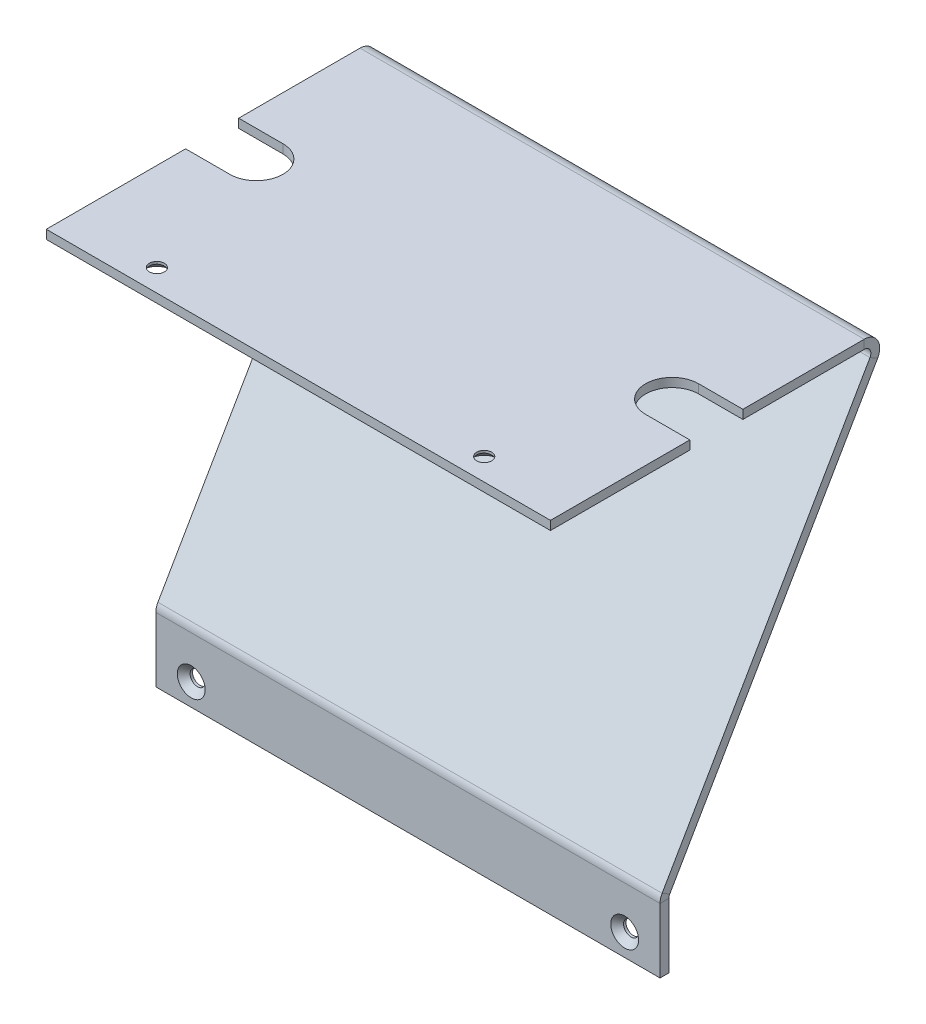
ISO-10303-21;
HEADER;
FILE_DESCRIPTION(('STEP AP214'),'2;1');
FILE_NAME('part.step','',(''),(''),'','','');
FILE_SCHEMA(('AUTOMOTIVE_DESIGN { 1 0 10303 214 1 1 1 1 }'));
ENDSEC;
DATA;
#1=APPLICATION_CONTEXT('core data for automotive mechanical design processes');
#2=APPLICATION_PROTOCOL_DEFINITION('international standard','automotive_design',2000,#1);
#3=PRODUCT_CONTEXT('',#1,'mechanical');
#4=PRODUCT('Part','Part','',(#3));
#5=PRODUCT_RELATED_PRODUCT_CATEGORY('part','',(#4));
#6=PRODUCT_DEFINITION_FORMATION('','',#4);
#7=PRODUCT_DEFINITION_CONTEXT('part definition',#1,'design');
#8=PRODUCT_DEFINITION('design','',#6,#7);
#9=PRODUCT_DEFINITION_SHAPE('','',#8);
#10=(LENGTH_UNIT() NAMED_UNIT(*) SI_UNIT(.MILLI.,.METRE.));
#11=(NAMED_UNIT(*) PLANE_ANGLE_UNIT() SI_UNIT($,.RADIAN.));
#12=(NAMED_UNIT(*) SI_UNIT($,.STERADIAN.) SOLID_ANGLE_UNIT());
#13=UNCERTAINTY_MEASURE_WITH_UNIT(LENGTH_MEASURE(1.E-05),#10,'distance_accuracy_value','');
#14=(GEOMETRIC_REPRESENTATION_CONTEXT(3) GLOBAL_UNCERTAINTY_ASSIGNED_CONTEXT((#13)) GLOBAL_UNIT_ASSIGNED_CONTEXT((#10,
#11,#12)) REPRESENTATION_CONTEXT('',''));
#15=CARTESIAN_POINT('',(0.,0.,0.));
#16=DIRECTION('',(0.,0.,1.));
#17=DIRECTION('',(1.,0.,0.));
#18=AXIS2_PLACEMENT_3D('',#15,#16,#17);
#19=CARTESIAN_POINT('',(57.,0.,0.));
#20=DIRECTION('',(0.,1.,0.));
#21=DIRECTION('',(0.,0.,1.));
#22=AXIS2_PLACEMENT_3D('',#19,#20,#21);
#23=PLANE('',#22);
#24=CARTESIAN_POINT('',(37.,0.,-4.99999999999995));
#25=DIRECTION('',(0.,-1.,0.));
#26=DIRECTION('',(0.,0.,-1.));
#27=AXIS2_PLACEMENT_3D('',#24,#25,#26);
#28=CIRCLE('',#27,1.7);
#29=CARTESIAN_POINT('',(37.,0.,-6.69999999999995));
#30=VERTEX_POINT('',#29);
#31=EDGE_CURVE('E367',#30,#30,#28,.T.);
#32=ORIENTED_EDGE('',*,*,#31,.T.);
#33=EDGE_LOOP('',(#32));
#34=FACE_BOUND('',#33,.T.);
#35=CARTESIAN_POINT('',(-37.,0.,-4.99999999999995));
#36=DIRECTION('',(0.,-1.,0.));
#37=DIRECTION('',(0.,0.,-1.));
#38=AXIS2_PLACEMENT_3D('',#35,#36,#37);
#39=CIRCLE('',#38,1.7);
#40=CARTESIAN_POINT('',(-37.,0.,-6.69999999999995));
#41=VERTEX_POINT('',#40);
#42=EDGE_CURVE('E191',#41,#41,#39,.T.);
#43=ORIENTED_EDGE('',*,*,#42,.T.);
#44=EDGE_LOOP('',(#43));
#45=FACE_BOUND('',#44,.T.);
#46=DIRECTION('',(0.,0.,-1.));
#47=VECTOR('',#46,1.);
#48=CARTESIAN_POINT('',(57.,0.,0.));
#49=LINE('',#48,#47);
#50=CARTESIAN_POINT('',(57.,0.,0.));
#51=VERTEX_POINT('',#50);
#52=CARTESIAN_POINT('',(57.,0.,-31.5));
#53=VERTEX_POINT('',#52);
#54=EDGE_CURVE('E195',#51,#53,#49,.T.);
#55=ORIENTED_EDGE('',*,*,#54,.T.);
#56=DIRECTION('',(-1.,0.,0.));
#57=VECTOR('',#56,1.);
#58=CARTESIAN_POINT('',(47.,0.,-31.5));
#59=LINE('',#58,#57);
#60=CARTESIAN_POINT('',(47.,0.,-31.5));
#61=VERTEX_POINT('',#60);
#62=EDGE_CURVE('E176',#53,#61,#59,.T.);
#63=ORIENTED_EDGE('',*,*,#62,.T.);
#64=CARTESIAN_POINT('',(47.,0.,-37.5));
#65=DIRECTION('',(0.,-1.,0.));
#66=DIRECTION('',(0.,0.,1.));
#67=AXIS2_PLACEMENT_3D('',#64,#65,#66);
#68=CIRCLE('',#67,6.);
#69=CARTESIAN_POINT('',(47.,0.,-43.5));
#70=VERTEX_POINT('',#69);
#71=EDGE_CURVE('E186',#61,#70,#68,.T.);
#72=ORIENTED_EDGE('',*,*,#71,.T.);
#73=DIRECTION('',(1.,0.,0.));
#74=VECTOR('',#73,1.);
#75=CARTESIAN_POINT('',(47.,0.,-43.5));
#76=LINE('',#75,#74);
#77=CARTESIAN_POINT('',(57.,0.,-43.5));
#78=VERTEX_POINT('',#77);
#79=EDGE_CURVE('E183',#70,#78,#76,.T.);
#80=ORIENTED_EDGE('',*,*,#79,.T.);
#81=CARTESIAN_POINT('',(57.,0.,-70.9378221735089));
#82=VERTEX_POINT('',#81);
#83=EDGE_CURVE('E241',#78,#82,#49,.T.);
#84=ORIENTED_EDGE('',*,*,#83,.T.);
#85=DIRECTION('',(-1.,0.,0.));
#86=VECTOR('',#85,1.);
#87=CARTESIAN_POINT('',(57.,0.,-70.9378221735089));
#88=LINE('',#87,#86);
#89=CARTESIAN_POINT('',(-57.,0.,-70.9378221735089));
#90=VERTEX_POINT('',#89);
#91=EDGE_CURVE('E311',#82,#90,#88,.T.);
#92=ORIENTED_EDGE('',*,*,#91,.T.);
#93=DIRECTION('',(0.,0.,-1.));
#94=VECTOR('',#93,1.);
#95=CARTESIAN_POINT('',(-57.,0.,0.));
#96=LINE('',#95,#94);
#97=CARTESIAN_POINT('',(-57.,0.,-43.5));
#98=VERTEX_POINT('',#97);
#99=EDGE_CURVE('E277',#98,#90,#96,.T.);
#100=ORIENTED_EDGE('',*,*,#99,.F.);
#101=DIRECTION('',(-1.,0.,0.));
#102=VECTOR('',#101,1.);
#103=CARTESIAN_POINT('',(-47.,0.,-43.5));
#104=LINE('',#103,#102);
#105=CARTESIAN_POINT('',(-47.,0.,-43.5));
#106=VERTEX_POINT('',#105);
#107=EDGE_CURVE('E210',#106,#98,#104,.T.);
#108=ORIENTED_EDGE('',*,*,#107,.F.);
#109=CARTESIAN_POINT('',(-47.,0.,-37.5));
#110=DIRECTION('',(0.,1.,0.));
#111=DIRECTION('',(0.,0.,1.));
#112=AXIS2_PLACEMENT_3D('',#109,#110,#111);
#113=CIRCLE('',#112,6.);
#114=CARTESIAN_POINT('',(-47.,0.,-31.5));
#115=VERTEX_POINT('',#114);
#116=EDGE_CURVE('E207',#115,#106,#113,.T.);
#117=ORIENTED_EDGE('',*,*,#116,.F.);
#118=DIRECTION('',(1.,0.,0.));
#119=VECTOR('',#118,1.);
#120=CARTESIAN_POINT('',(-47.,0.,-31.5));
#121=LINE('',#120,#119);
#122=CARTESIAN_POINT('',(-57.,0.,-31.5));
#123=VERTEX_POINT('',#122);
#124=EDGE_CURVE('E213',#123,#115,#121,.T.);
#125=ORIENTED_EDGE('',*,*,#124,.F.);
#126=CARTESIAN_POINT('',(-57.,0.,0.));
#127=VERTEX_POINT('',#126);
#128=EDGE_CURVE('E278',#127,#123,#96,.T.);
#129=ORIENTED_EDGE('',*,*,#128,.F.);
#130=DIRECTION('',(-1.,0.,0.));
#131=VECTOR('',#130,1.);
#132=CARTESIAN_POINT('',(57.,0.,0.));
#133=LINE('',#132,#131);
#134=EDGE_CURVE('E309',#51,#127,#133,.T.);
#135=ORIENTED_EDGE('',*,*,#134,.F.);
#136=EDGE_LOOP('',(#55,#63,#72,#80,#84,#92,#100,#108,#117,#125,#129,#135));
#137=FACE_BOUND('',#136,.T.);
#138=ADVANCED_FACE('F34',(#34,#45,#137),#23,.T.);
#139=CARTESIAN_POINT('',(57.,-2.,0.));
#140=DIRECTION('',(0.,1.,0.));
#141=DIRECTION('',(0.,0.,1.));
#142=AXIS2_PLACEMENT_3D('',#139,#140,#141);
#143=PLANE('',#142);
#144=CARTESIAN_POINT('',(37.,-2.,-4.99999999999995));
#145=DIRECTION('',(0.,-1.,0.));
#146=DIRECTION('',(0.,0.,-1.));
#147=AXIS2_PLACEMENT_3D('',#144,#145,#146);
#148=CIRCLE('',#147,3.15);
#149=CARTESIAN_POINT('',(37.,-2.,-8.14999999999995));
#150=VERTEX_POINT('',#149);
#151=EDGE_CURVE('E349',#150,#150,#148,.T.);
#152=ORIENTED_EDGE('',*,*,#151,.F.);
#153=EDGE_LOOP('',(#152));
#154=FACE_BOUND('',#153,.T.);
#155=CARTESIAN_POINT('',(-37.,-2.,-4.99999999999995));
#156=DIRECTION('',(0.,-1.,0.));
#157=DIRECTION('',(0.,0.,-1.));
#158=AXIS2_PLACEMENT_3D('',#155,#156,#157);
#159=CIRCLE('',#158,3.15);
#160=CARTESIAN_POINT('',(-37.,-2.,-8.14999999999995));
#161=VERTEX_POINT('',#160);
#162=EDGE_CURVE('E370',#161,#161,#159,.T.);
#163=ORIENTED_EDGE('',*,*,#162,.F.);
#164=EDGE_LOOP('',(#163));
#165=FACE_BOUND('',#164,.T.);
#166=DIRECTION('',(1.,0.,0.));
#167=VECTOR('',#166,1.);
#168=CARTESIAN_POINT('',(47.,-2.,-31.5));
#169=LINE('',#168,#167);
#170=CARTESIAN_POINT('',(47.,-2.,-31.5));
#171=VERTEX_POINT('',#170);
#172=CARTESIAN_POINT('',(57.,-2.,-31.5));
#173=VERTEX_POINT('',#172);
#174=EDGE_CURVE('E179',#171,#173,#169,.T.);
#175=ORIENTED_EDGE('',*,*,#174,.T.);
#176=DIRECTION('',(0.,0.,-1.));
#177=VECTOR('',#176,1.);
#178=CARTESIAN_POINT('',(57.,-2.,0.));
#179=LINE('',#178,#177);
#180=CARTESIAN_POINT('',(57.,-2.,0.));
#181=VERTEX_POINT('',#180);
#182=EDGE_CURVE('E247',#181,#173,#179,.T.);
#183=ORIENTED_EDGE('',*,*,#182,.F.);
#184=DIRECTION('',(-1.,0.,0.));
#185=VECTOR('',#184,1.);
#186=CARTESIAN_POINT('',(57.,-2.,0.));
#187=LINE('',#186,#185);
#188=CARTESIAN_POINT('',(-57.,-2.,0.));
#189=VERTEX_POINT('',#188);
#190=EDGE_CURVE('E307',#181,#189,#187,.T.);
#191=ORIENTED_EDGE('',*,*,#190,.T.);
#192=DIRECTION('',(0.,0.,-1.));
#193=VECTOR('',#192,1.);
#194=CARTESIAN_POINT('',(-57.,-2.,0.));
#195=LINE('',#194,#193);
#196=CARTESIAN_POINT('',(-57.,-2.,-31.5));
#197=VERTEX_POINT('',#196);
#198=EDGE_CURVE('E285',#189,#197,#195,.T.);
#199=ORIENTED_EDGE('',*,*,#198,.T.);
#200=DIRECTION('',(-1.,0.,0.));
#201=VECTOR('',#200,1.);
#202=CARTESIAN_POINT('',(-47.,-2.,-31.5));
#203=LINE('',#202,#201);
#204=CARTESIAN_POINT('',(-47.,-2.,-31.5));
#205=VERTEX_POINT('',#204);
#206=EDGE_CURVE('E202',#205,#197,#203,.T.);
#207=ORIENTED_EDGE('',*,*,#206,.F.);
#208=CARTESIAN_POINT('',(-47.,-2.,-37.5));
#209=DIRECTION('',(0.,1.,0.));
#210=DIRECTION('',(0.,0.,1.));
#211=AXIS2_PLACEMENT_3D('',#208,#209,#210);
#212=CIRCLE('',#211,6.);
#213=CARTESIAN_POINT('',(-47.,-2.,-43.5));
#214=VERTEX_POINT('',#213);
#215=EDGE_CURVE('E204',#214,#205,#212,.F.);
#216=ORIENTED_EDGE('',*,*,#215,.F.);
#217=DIRECTION('',(-1.,0.,0.));
#218=VECTOR('',#217,1.);
#219=CARTESIAN_POINT('',(57.,-2.,-43.5));
#220=LINE('',#219,#218);
#221=CARTESIAN_POINT('',(-57.,-2.,-43.5));
#222=VERTEX_POINT('',#221);
#223=EDGE_CURVE('E345',#214,#222,#220,.T.);
#224=ORIENTED_EDGE('',*,*,#223,.T.);
#225=CARTESIAN_POINT('',(-57.,-2.,-70.9378221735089));
#226=VERTEX_POINT('',#225);
#227=EDGE_CURVE('E284',#222,#226,#195,.T.);
#228=ORIENTED_EDGE('',*,*,#227,.T.);
#229=DIRECTION('',(-1.,0.,0.));
#230=VECTOR('',#229,1.);
#231=CARTESIAN_POINT('',(57.,-2.,-70.9378221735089));
#232=LINE('',#231,#230);
#233=CARTESIAN_POINT('',(57.,-2.,-70.9378221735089));
#234=VERTEX_POINT('',#233);
#235=EDGE_CURVE('E304',#234,#226,#232,.T.);
#236=ORIENTED_EDGE('',*,*,#235,.F.);
#237=CARTESIAN_POINT('',(57.,-2.,-43.5));
#238=VERTEX_POINT('',#237);
#239=EDGE_CURVE('E246',#238,#234,#179,.T.);
#240=ORIENTED_EDGE('',*,*,#239,.F.);
#241=DIRECTION('',(-1.,0.,0.));
#242=VECTOR('',#241,1.);
#243=CARTESIAN_POINT('',(47.,-2.,-43.5));
#244=LINE('',#243,#242);
#245=CARTESIAN_POINT('',(47.,-2.,-43.5));
#246=VERTEX_POINT('',#245);
#247=EDGE_CURVE('E51',#238,#246,#244,.T.);
#248=ORIENTED_EDGE('',*,*,#247,.T.);
#249=CARTESIAN_POINT('',(47.,-2.,-37.5));
#250=DIRECTION('',(0.,1.,0.));
#251=DIRECTION('',(0.,0.,1.));
#252=AXIS2_PLACEMENT_3D('',#249,#250,#251);
#253=CIRCLE('',#252,6.);
#254=EDGE_CURVE('E211',#246,#171,#253,.T.);
#255=ORIENTED_EDGE('',*,*,#254,.T.);
#256=EDGE_LOOP('',(#175,#183,#191,#199,#207,#216,#224,#228,#236,#240,#248,#255));
#257=FACE_BOUND('',#256,.T.);
#258=ADVANCED_FACE('F379',(#154,#165,#257),#143,.F.);
#259=CARTESIAN_POINT('',(57.,-87.4019237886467,-28.270526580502));
#260=DIRECTION('',(-1.,0.,0.));
#261=DIRECTION('',(0.,0.,1.));
#262=AXIS2_PLACEMENT_3D('',#259,#260,#261);
#263=PLANE('',#262);
#264=DIRECTION('',(0.,-1.,0.));
#265=VECTOR('',#264,1.);
#266=CARTESIAN_POINT('',(57.,-87.4019237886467,-31.5));
#267=LINE('',#266,#265);
#268=EDGE_CURVE('E11',#53,#173,#267,.T.);
#269=ORIENTED_EDGE('',*,*,#268,.F.);
#270=ORIENTED_EDGE('',*,*,#54,.F.);
#271=DIRECTION('',(0.,1.,0.));
#272=VECTOR('',#271,1.);
#273=CARTESIAN_POINT('',(57.,-2.,0.));
#274=LINE('',#273,#272);
#275=EDGE_CURVE('E243',#181,#51,#274,.T.);
#276=ORIENTED_EDGE('',*,*,#275,.F.);
#277=ORIENTED_EDGE('',*,*,#182,.T.);
#278=EDGE_LOOP('',(#269,#270,#276,#277));
#279=FACE_BOUND('',#278,.T.);
#280=ADVANCED_FACE('F457',(#279),#263,.F.);
#281=DIRECTION('',(0.,1.,0.));
#282=VECTOR('',#281,1.);
#283=CARTESIAN_POINT('',(57.,-87.4019237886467,-43.5));
#284=LINE('',#283,#282);
#285=EDGE_CURVE('E43',#238,#78,#284,.T.);
#286=ORIENTED_EDGE('',*,*,#285,.F.);
#287=ORIENTED_EDGE('',*,*,#239,.T.);
#288=DIRECTION('',(0.,1.,0.));
#289=VECTOR('',#288,1.);
#290=CARTESIAN_POINT('',(57.,-2.,-70.9378221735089));
#291=LINE('',#290,#289);
#292=EDGE_CURVE('E340',#234,#82,#291,.T.);
#293=ORIENTED_EDGE('',*,*,#292,.T.);
#294=ORIENTED_EDGE('',*,*,#83,.F.);
#295=EDGE_LOOP('',(#286,#287,#293,#294));
#296=FACE_BOUND('',#295,.T.);
#297=ADVANCED_FACE('F385',(#296),#263,.F.);
#298=CARTESIAN_POINT('',(-57.,-4.25000000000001,-72.2368602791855));
#299=DIRECTION('',(-1.,0.,0.));
#300=DIRECTION('',(0.,0.,1.));
#301=AXIS2_PLACEMENT_3D('',#298,#299,#300);
#302=PLANE('',#301);
#303=DIRECTION('',(0.,1.,0.));
#304=VECTOR('',#303,1.);
#305=CARTESIAN_POINT('',(-57.,-4.25000000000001,-31.5));
#306=LINE('',#305,#304);
#307=EDGE_CURVE('E220',#197,#123,#306,.T.);
#308=ORIENTED_EDGE('',*,*,#307,.F.);
#309=ORIENTED_EDGE('',*,*,#198,.F.);
#310=DIRECTION('',(0.,1.,0.));
#311=VECTOR('',#310,1.);
#312=CARTESIAN_POINT('',(-57.,-2.,0.));
#313=LINE('',#312,#311);
#314=EDGE_CURVE('E281',#189,#127,#313,.T.);
#315=ORIENTED_EDGE('',*,*,#314,.T.);
#316=ORIENTED_EDGE('',*,*,#128,.T.);
#317=EDGE_LOOP('',(#308,#309,#315,#316));
#318=FACE_BOUND('',#317,.T.);
#319=ADVANCED_FACE('F573',(#318),#302,.T.);
#320=CARTESIAN_POINT('',(57.,-5.25000000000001,-73.9689110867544));
#321=DIRECTION('',(1.,0.,0.));
#322=DIRECTION('',(0.,0.,-1.));
#323=AXIS2_PLACEMENT_3D('',#320,#321,#322);
#324=PLANE('',#323);
#325=DIRECTION('',(0.,0.500000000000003,0.866025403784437));
#326=VECTOR('',#325,1.);
#327=CARTESIAN_POINT('',(57.,-5.25000000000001,-73.9689110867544));
#328=LINE('',#327,#326);
#329=CARTESIAN_POINT('',(57.,-5.25000000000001,-73.9689110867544));
#330=VERTEX_POINT('',#329);
#331=CARTESIAN_POINT('',(57.,-4.25000000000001,-72.2368602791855));
#332=VERTEX_POINT('',#331);
#333=EDGE_CURVE('E343',#330,#332,#328,.T.);
#334=ORIENTED_EDGE('',*,*,#333,.F.);
#335=CARTESIAN_POINT('',(57.,-3.5,-70.9378221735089));
#336=DIRECTION('',(1.,0.,0.));
#337=DIRECTION('',(0.,0.,-1.));
#338=AXIS2_PLACEMENT_3D('',#335,#336,#337);
#339=CIRCLE('',#338,3.5);
#340=EDGE_CURVE('E238',#82,#330,#339,.F.);
#341=ORIENTED_EDGE('',*,*,#340,.F.);
#342=ORIENTED_EDGE('',*,*,#292,.F.);
#343=CARTESIAN_POINT('',(57.,-3.5,-70.9378221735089));
#344=DIRECTION('',(1.,0.,0.));
#345=DIRECTION('',(0.,0.,-1.));
#346=AXIS2_PLACEMENT_3D('',#343,#344,#345);
#347=CIRCLE('',#346,1.5);
#348=EDGE_CURVE('E250',#234,#332,#347,.F.);
#349=ORIENTED_EDGE('',*,*,#348,.T.);
#350=EDGE_LOOP('',(#334,#341,#342,#349));
#351=FACE_BOUND('',#350,.T.);
#352=ADVANCED_FACE('F36',(#351),#324,.T.);
#353=CARTESIAN_POINT('',(57.,-2.,-70.9378221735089));
#354=DIRECTION('',(1.,0.,0.));
#355=DIRECTION('',(0.,0.,-1.));
#356=AXIS2_PLACEMENT_3D('',#353,#354,#355);
#357=PLANE('',#356);
#358=DIRECTION('',(0.,-0.866025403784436,0.500000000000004));
#359=VECTOR('',#358,1.);
#360=CARTESIAN_POINT('',(57.,0.,-77.));
#361=LINE('',#360,#359);
#362=CARTESIAN_POINT('',(57.,-86.6519237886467,-26.9714884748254));
#363=VERTEX_POINT('',#362);
#364=EDGE_CURVE('E235',#330,#363,#361,.T.);
#365=ORIENTED_EDGE('',*,*,#364,.F.);
#366=ORIENTED_EDGE('',*,*,#333,.T.);
#367=DIRECTION('',(0.,-0.866025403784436,0.500000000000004));
#368=VECTOR('',#367,1.);
#369=CARTESIAN_POINT('',(57.,1.00000000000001,-75.2679491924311));
#370=LINE('',#369,#368);
#371=CARTESIAN_POINT('',(57.,-85.6519237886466,-25.2394376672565));
#372=VERTEX_POINT('',#371);
#373=EDGE_CURVE('E253',#332,#372,#370,.T.);
#374=ORIENTED_EDGE('',*,*,#373,.T.);
#375=DIRECTION('',(0.,-0.500000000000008,-0.866025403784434));
#376=VECTOR('',#375,1.);
#377=CARTESIAN_POINT('',(57.,-85.6519237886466,-25.2394376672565));
#378=LINE('',#377,#376);
#379=EDGE_CURVE('E331',#372,#363,#378,.T.);
#380=ORIENTED_EDGE('',*,*,#379,.T.);
#381=EDGE_LOOP('',(#365,#366,#374,#380));
#382=FACE_BOUND('',#381,.T.);
#383=ADVANCED_FACE('F403',(#382),#357,.T.);
#384=CARTESIAN_POINT('',(-57.,0.,-70.9378221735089));
#385=DIRECTION('',(-1.,0.,0.));
#386=DIRECTION('',(0.,0.,1.));
#387=AXIS2_PLACEMENT_3D('',#384,#385,#386);
#388=PLANE('',#387);
#389=DIRECTION('',(0.,-1.,0.));
#390=VECTOR('',#389,1.);
#391=CARTESIAN_POINT('',(-57.,0.,-70.9378221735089));
#392=LINE('',#391,#390);
#393=EDGE_CURVE('E337',#90,#226,#392,.T.);
#394=ORIENTED_EDGE('',*,*,#393,.F.);
#395=CARTESIAN_POINT('',(-57.,-3.5,-70.9378221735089));
#396=DIRECTION('',(1.,0.,0.));
#397=DIRECTION('',(0.,0.,-1.));
#398=AXIS2_PLACEMENT_3D('',#395,#396,#397);
#399=CIRCLE('',#398,3.5);
#400=CARTESIAN_POINT('',(-57.,-5.25000000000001,-73.9689110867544));
#401=VERTEX_POINT('',#400);
#402=EDGE_CURVE('E274',#90,#401,#399,.F.);
#403=ORIENTED_EDGE('',*,*,#402,.T.);
#404=DIRECTION('',(0.,-0.500000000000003,-0.866025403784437));
#405=VECTOR('',#404,1.);
#406=CARTESIAN_POINT('',(-57.,-4.25000000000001,-72.2368602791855));
#407=LINE('',#406,#405);
#408=CARTESIAN_POINT('',(-57.,-4.25000000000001,-72.2368602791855));
#409=VERTEX_POINT('',#408);
#410=EDGE_CURVE('E335',#409,#401,#407,.T.);
#411=ORIENTED_EDGE('',*,*,#410,.F.);
#412=CARTESIAN_POINT('',(-57.,-3.5,-70.9378221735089));
#413=DIRECTION('',(1.,0.,0.));
#414=DIRECTION('',(0.,0.,-1.));
#415=AXIS2_PLACEMENT_3D('',#412,#413,#414);
#416=CIRCLE('',#415,1.5);
#417=EDGE_CURVE('E288',#226,#409,#416,.F.);
#418=ORIENTED_EDGE('',*,*,#417,.F.);
#419=EDGE_LOOP('',(#394,#403,#411,#418));
#420=FACE_BOUND('',#419,.T.);
#421=ADVANCED_FACE('F558',(#420),#388,.T.);
#422=DIRECTION('',(0.,-1.,0.));
#423=VECTOR('',#422,1.);
#424=CARTESIAN_POINT('',(-57.,-4.25000000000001,-43.5));
#425=LINE('',#424,#423);
#426=EDGE_CURVE('E59',#98,#222,#425,.T.);
#427=ORIENTED_EDGE('',*,*,#426,.F.);
#428=ORIENTED_EDGE('',*,*,#99,.T.);
#429=ORIENTED_EDGE('',*,*,#393,.T.);
#430=ORIENTED_EDGE('',*,*,#227,.F.);
#431=EDGE_LOOP('',(#427,#428,#429,#430));
#432=FACE_BOUND('',#431,.T.);
#433=ADVANCED_FACE('F561',(#432),#302,.T.);
#434=CARTESIAN_POINT('',(57.,-87.4019237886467,-26.770526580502));
#435=DIRECTION('',(1.,0.,0.));
#436=DIRECTION('',(0.,0.,-1.));
#437=AXIS2_PLACEMENT_3D('',#434,#435,#436);
#438=PLANE('',#437);
#439=DIRECTION('',(0.,0.,1.));
#440=VECTOR('',#439,1.);
#441=CARTESIAN_POINT('',(57.,-87.4019237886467,-26.770526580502));
#442=LINE('',#441,#440);
#443=CARTESIAN_POINT('',(57.,-87.4019237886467,-26.770526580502));
#444=VERTEX_POINT('',#443);
#445=CARTESIAN_POINT('',(57.,-87.4019237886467,-24.770526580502));
#446=VERTEX_POINT('',#445);
#447=EDGE_CURVE('E333',#444,#446,#442,.T.);
#448=ORIENTED_EDGE('',*,*,#447,.F.);
#449=CARTESIAN_POINT('',(57.,-87.4019237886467,-28.270526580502));
#450=DIRECTION('',(-1.,0.,0.));
#451=DIRECTION('',(0.,0.,1.));
#452=AXIS2_PLACEMENT_3D('',#449,#450,#451);
#453=CIRCLE('',#452,1.5);
#454=EDGE_CURVE('E232',#363,#444,#453,.F.);
#455=ORIENTED_EDGE('',*,*,#454,.F.);
#456=ORIENTED_EDGE('',*,*,#379,.F.);
#457=CARTESIAN_POINT('',(57.,-87.4019237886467,-28.270526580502));
#458=DIRECTION('',(1.,0.,0.));
#459=DIRECTION('',(0.,0.,-1.));
#460=AXIS2_PLACEMENT_3D('',#457,#458,#459);
#461=CIRCLE('',#460,3.5);
#462=EDGE_CURVE('E256',#372,#446,#461,.T.);
#463=ORIENTED_EDGE('',*,*,#462,.T.);
#464=EDGE_LOOP('',(#448,#455,#456,#463));
#465=FACE_BOUND('',#464,.T.);
#466=ADVANCED_FACE('F412',(#465),#438,.T.);
#467=CARTESIAN_POINT('',(57.,-85.6519237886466,-25.2394376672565));
#468=DIRECTION('',(1.,0.,0.));
#469=DIRECTION('',(0.,0.,-1.));
#470=AXIS2_PLACEMENT_3D('',#467,#468,#469);
#471=PLANE('',#470);
#472=DIRECTION('',(0.,-1.,0.));
#473=VECTOR('',#472,1.);
#474=CARTESIAN_POINT('',(57.,-87.,-26.770526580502));
#475=LINE('',#474,#473);
#476=CARTESIAN_POINT('',(57.,-102.,-26.770526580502));
#477=VERTEX_POINT('',#476);
#478=EDGE_CURVE('E229',#444,#477,#475,.T.);
#479=ORIENTED_EDGE('',*,*,#478,.F.);
#480=ORIENTED_EDGE('',*,*,#447,.T.);
#481=DIRECTION('',(0.,-1.,0.));
#482=VECTOR('',#481,1.);
#483=CARTESIAN_POINT('',(57.,-87.,-24.770526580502));
#484=LINE('',#483,#482);
#485=CARTESIAN_POINT('',(57.,-102.,-24.770526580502));
#486=VERTEX_POINT('',#485);
#487=EDGE_CURVE('E223',#446,#486,#484,.T.);
#488=ORIENTED_EDGE('',*,*,#487,.T.);
#489=DIRECTION('',(0.,0.,1.));
#490=VECTOR('',#489,1.);
#491=CARTESIAN_POINT('',(57.,-102.,-26.770526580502));
#492=LINE('',#491,#490);
#493=EDGE_CURVE('E225',#477,#486,#492,.T.);
#494=ORIENTED_EDGE('',*,*,#493,.F.);
#495=EDGE_LOOP('',(#479,#480,#488,#494));
#496=FACE_BOUND('',#495,.T.);
#497=ADVANCED_FACE('F422',(#496),#471,.T.);
#498=CARTESIAN_POINT('',(-57.,-86.6519237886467,-26.9714884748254));
#499=DIRECTION('',(-1.,0.,0.));
#500=DIRECTION('',(0.,0.,1.));
#501=AXIS2_PLACEMENT_3D('',#498,#499,#500);
#502=PLANE('',#501);
#503=DIRECTION('',(0.,0.500000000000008,0.866025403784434));
#504=VECTOR('',#503,1.);
#505=CARTESIAN_POINT('',(-57.,-86.6519237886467,-26.9714884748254));
#506=LINE('',#505,#504);
#507=CARTESIAN_POINT('',(-57.,-86.6519237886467,-26.9714884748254));
#508=VERTEX_POINT('',#507);
#509=CARTESIAN_POINT('',(-57.,-85.6519237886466,-25.2394376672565));
#510=VERTEX_POINT('',#509);
#511=EDGE_CURVE('E329',#508,#510,#506,.T.);
#512=ORIENTED_EDGE('',*,*,#511,.F.);
#513=CARTESIAN_POINT('',(-57.,-87.4019237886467,-28.270526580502));
#514=DIRECTION('',(-1.,0.,0.));
#515=DIRECTION('',(0.,0.,1.));
#516=AXIS2_PLACEMENT_3D('',#513,#514,#515);
#517=CIRCLE('',#516,1.5);
#518=CARTESIAN_POINT('',(-57.,-87.4019237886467,-26.770526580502));
#519=VERTEX_POINT('',#518);
#520=EDGE_CURVE('E268',#508,#519,#517,.F.);
#521=ORIENTED_EDGE('',*,*,#520,.T.);
#522=DIRECTION('',(0.,0.,-1.));
#523=VECTOR('',#522,1.);
#524=CARTESIAN_POINT('',(-57.,-87.4019237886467,-24.770526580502));
#525=LINE('',#524,#523);
#526=CARTESIAN_POINT('',(-57.,-87.4019237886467,-24.770526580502));
#527=VERTEX_POINT('',#526);
#528=EDGE_CURVE('E327',#527,#519,#525,.T.);
#529=ORIENTED_EDGE('',*,*,#528,.F.);
#530=CARTESIAN_POINT('',(-57.,-87.4019237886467,-28.270526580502));
#531=DIRECTION('',(1.,0.,0.));
#532=DIRECTION('',(0.,0.,-1.));
#533=AXIS2_PLACEMENT_3D('',#530,#531,#532);
#534=CIRCLE('',#533,3.5);
#535=EDGE_CURVE('E226',#510,#527,#534,.T.);
#536=ORIENTED_EDGE('',*,*,#535,.F.);
#537=EDGE_LOOP('',(#512,#521,#529,#536));
#538=FACE_BOUND('',#537,.T.);
#539=ADVANCED_FACE('F433',(#538),#502,.T.);
#540=CARTESIAN_POINT('',(-57.,-87.4019237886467,-24.770526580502));
#541=DIRECTION('',(-1.,0.,0.));
#542=DIRECTION('',(0.,0.,1.));
#543=AXIS2_PLACEMENT_3D('',#540,#541,#542);
#544=PLANE('',#543);
#545=DIRECTION('',(0.,-0.866025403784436,0.500000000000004));
#546=VECTOR('',#545,1.);
#547=CARTESIAN_POINT('',(-57.,0.,-77.));
#548=LINE('',#547,#546);
#549=EDGE_CURVE('E271',#401,#508,#548,.T.);
#550=ORIENTED_EDGE('',*,*,#549,.T.);
#551=ORIENTED_EDGE('',*,*,#511,.T.);
#552=DIRECTION('',(0.,-0.866025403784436,0.500000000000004));
#553=VECTOR('',#552,1.);
#554=CARTESIAN_POINT('',(-57.,1.00000000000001,-75.2679491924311));
#555=LINE('',#554,#553);
#556=EDGE_CURVE('E291',#409,#510,#555,.T.);
#557=ORIENTED_EDGE('',*,*,#556,.F.);
#558=ORIENTED_EDGE('',*,*,#410,.T.);
#559=EDGE_LOOP('',(#550,#551,#557,#558));
#560=FACE_BOUND('',#559,.T.);
#561=ADVANCED_FACE('F439',(#560),#544,.T.);
#562=CARTESIAN_POINT('',(57.,-87.,-24.770526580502));
#563=DIRECTION('',(0.,0.,-1.));
#564=DIRECTION('',(0.,1.,0.));
#565=AXIS2_PLACEMENT_3D('',#562,#563,#564);
#566=PLANE('',#565);
#567=CARTESIAN_POINT('',(-49.,-96.9999999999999,-24.770526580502));
#568=DIRECTION('',(0.,0.,1.));
#569=DIRECTION('',(1.,0.,0.));
#570=AXIS2_PLACEMENT_3D('',#567,#568,#569);
#571=CIRCLE('',#570,3.15);
#572=CARTESIAN_POINT('',(-45.85,-96.9999999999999,-24.770526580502));
#573=VERTEX_POINT('',#572);
#574=EDGE_CURVE('E480',#573,#573,#571,.T.);
#575=ORIENTED_EDGE('',*,*,#574,.F.);
#576=EDGE_LOOP('',(#575));
#577=FACE_BOUND('',#576,.T.);
#578=CARTESIAN_POINT('',(49.,-96.9999999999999,-24.770526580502));
#579=DIRECTION('',(0.,0.,1.));
#580=DIRECTION('',(1.,0.,0.));
#581=AXIS2_PLACEMENT_3D('',#578,#579,#580);
#582=CIRCLE('',#581,3.15);
#583=CARTESIAN_POINT('',(52.15,-96.9999999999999,-24.770526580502));
#584=VERTEX_POINT('',#583);
#585=EDGE_CURVE('E357',#584,#584,#582,.T.);
#586=ORIENTED_EDGE('',*,*,#585,.F.);
#587=EDGE_LOOP('',(#586));
#588=FACE_BOUND('',#587,.T.);
#589=DIRECTION('',(0.,-1.,0.));
#590=VECTOR('',#589,1.);
#591=CARTESIAN_POINT('',(-57.,-87.,-24.770526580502));
#592=LINE('',#591,#590);
#593=CARTESIAN_POINT('',(-57.,-102.,-24.770526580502));
#594=VERTEX_POINT('',#593);
#595=EDGE_CURVE('E222',#527,#594,#592,.T.);
#596=ORIENTED_EDGE('',*,*,#595,.T.);
#597=DIRECTION('',(-1.,0.,0.));
#598=VECTOR('',#597,1.);
#599=CARTESIAN_POINT('',(57.,-102.,-24.770526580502));
#600=LINE('',#599,#598);
#601=EDGE_CURVE('E325',#486,#594,#600,.T.);
#602=ORIENTED_EDGE('',*,*,#601,.F.);
#603=ORIENTED_EDGE('',*,*,#487,.F.);
#604=DIRECTION('',(-1.,0.,0.));
#605=VECTOR('',#604,1.);
#606=CARTESIAN_POINT('',(57.,-87.4019237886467,-24.770526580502));
#607=LINE('',#606,#605);
#608=EDGE_CURVE('E259',#446,#527,#607,.T.);
#609=ORIENTED_EDGE('',*,*,#608,.T.);
#610=EDGE_LOOP('',(#596,#602,#603,#609));
#611=FACE_BOUND('',#610,.T.);
#612=ADVANCED_FACE('F437',(#577,#588,#611),#566,.F.);
#613=CARTESIAN_POINT('',(57.,-102.,-26.770526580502));
#614=DIRECTION('',(0.,-1.,0.));
#615=DIRECTION('',(0.,0.,-1.));
#616=AXIS2_PLACEMENT_3D('',#613,#614,#615);
#617=PLANE('',#616);
#618=DIRECTION('',(0.,0.,1.));
#619=VECTOR('',#618,1.);
#620=CARTESIAN_POINT('',(-57.,-102.,-26.770526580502));
#621=LINE('',#620,#619);
#622=CARTESIAN_POINT('',(-57.,-102.,-26.770526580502));
#623=VERTEX_POINT('',#622);
#624=EDGE_CURVE('E262',#623,#594,#621,.T.);
#625=ORIENTED_EDGE('',*,*,#624,.F.);
#626=DIRECTION('',(-1.,0.,0.));
#627=VECTOR('',#626,1.);
#628=CARTESIAN_POINT('',(57.,-102.,-26.770526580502));
#629=LINE('',#628,#627);
#630=EDGE_CURVE('E323',#477,#623,#629,.T.);
#631=ORIENTED_EDGE('',*,*,#630,.F.);
#632=ORIENTED_EDGE('',*,*,#493,.T.);
#633=ORIENTED_EDGE('',*,*,#601,.T.);
#634=EDGE_LOOP('',(#625,#631,#632,#633));
#635=FACE_BOUND('',#634,.T.);
#636=ADVANCED_FACE('F427',(#635),#617,.T.);
#637=CARTESIAN_POINT('',(57.,-87.,-26.770526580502));
#638=DIRECTION('',(0.,0.,-1.));
#639=DIRECTION('',(0.,1.,0.));
#640=AXIS2_PLACEMENT_3D('',#637,#638,#639);
#641=PLANE('',#640);
#642=CARTESIAN_POINT('',(-49.,-96.9999999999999,-26.770526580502));
#643=DIRECTION('',(0.,0.,-1.));
#644=DIRECTION('',(0.,1.,0.));
#645=AXIS2_PLACEMENT_3D('',#642,#643,#644);
#646=CIRCLE('',#645,1.69999999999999);
#647=CARTESIAN_POINT('',(-49.,-95.2999999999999,-26.770526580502));
#648=VERTEX_POINT('',#647);
#649=EDGE_CURVE('E38',#648,#648,#646,.T.);
#650=ORIENTED_EDGE('',*,*,#649,.F.);
#651=EDGE_LOOP('',(#650));
#652=FACE_BOUND('',#651,.T.);
#653=CARTESIAN_POINT('',(49.,-96.9999999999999,-26.770526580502));
#654=DIRECTION('',(0.,0.,-1.));
#655=DIRECTION('',(0.,1.,0.));
#656=AXIS2_PLACEMENT_3D('',#653,#654,#655);
#657=CIRCLE('',#656,1.69999999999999);
#658=CARTESIAN_POINT('',(49.,-95.2999999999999,-26.770526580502));
#659=VERTEX_POINT('',#658);
#660=EDGE_CURVE('E347',#659,#659,#657,.T.);
#661=ORIENTED_EDGE('',*,*,#660,.F.);
#662=EDGE_LOOP('',(#661));
#663=FACE_BOUND('',#662,.T.);
#664=DIRECTION('',(0.,-1.,0.));
#665=VECTOR('',#664,1.);
#666=CARTESIAN_POINT('',(-57.,-87.,-26.770526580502));
#667=LINE('',#666,#665);
#668=EDGE_CURVE('E265',#519,#623,#667,.T.);
#669=ORIENTED_EDGE('',*,*,#668,.F.);
#670=DIRECTION('',(-1.,0.,0.));
#671=VECTOR('',#670,1.);
#672=CARTESIAN_POINT('',(57.,-87.4019237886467,-26.770526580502));
#673=LINE('',#672,#671);
#674=EDGE_CURVE('E320',#444,#519,#673,.T.);
#675=ORIENTED_EDGE('',*,*,#674,.F.);
#676=ORIENTED_EDGE('',*,*,#478,.T.);
#677=ORIENTED_EDGE('',*,*,#630,.T.);
#678=EDGE_LOOP('',(#669,#675,#676,#677));
#679=FACE_BOUND('',#678,.T.);
#680=ADVANCED_FACE('F420',(#652,#663,#679),#641,.T.);
#681=CARTESIAN_POINT('',(57.,-87.4019237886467,-28.270526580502));
#682=DIRECTION('',(-1.,0.,0.));
#683=DIRECTION('',(0.,0.,1.));
#684=AXIS2_PLACEMENT_3D('',#681,#682,#683);
#685=CYLINDRICAL_SURFACE('',#684,1.5);
#686=ORIENTED_EDGE('',*,*,#520,.F.);
#687=DIRECTION('',(-1.,0.,0.));
#688=VECTOR('',#687,1.);
#689=CARTESIAN_POINT('',(57.,-86.6519237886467,-26.9714884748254));
#690=LINE('',#689,#688);
#691=EDGE_CURVE('E317',#363,#508,#690,.T.);
#692=ORIENTED_EDGE('',*,*,#691,.F.);
#693=ORIENTED_EDGE('',*,*,#454,.T.);
#694=ORIENTED_EDGE('',*,*,#674,.T.);
#695=EDGE_LOOP('',(#686,#692,#693,#694));
#696=FACE_BOUND('',#695,.T.);
#697=ADVANCED_FACE('F411',(#696),#685,.F.);
#698=CARTESIAN_POINT('',(57.,0.,-77.));
#699=DIRECTION('',(0.,-0.500000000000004,-0.866025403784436));
#700=DIRECTION('',(0.,0.866025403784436,-0.500000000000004));
#701=AXIS2_PLACEMENT_3D('',#698,#699,#700);
#702=PLANE('',#701);
#703=ORIENTED_EDGE('',*,*,#549,.F.);
#704=DIRECTION('',(-1.,0.,0.));
#705=VECTOR('',#704,1.);
#706=CARTESIAN_POINT('',(57.,-5.25000000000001,-73.9689110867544));
#707=LINE('',#706,#705);
#708=EDGE_CURVE('E314',#330,#401,#707,.T.);
#709=ORIENTED_EDGE('',*,*,#708,.F.);
#710=ORIENTED_EDGE('',*,*,#364,.T.);
#711=ORIENTED_EDGE('',*,*,#691,.T.);
#712=EDGE_LOOP('',(#703,#709,#710,#711));
#713=FACE_BOUND('',#712,.T.);
#714=ADVANCED_FACE('F402',(#713),#702,.T.);
#715=CARTESIAN_POINT('',(57.,-3.5,-70.9378221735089));
#716=DIRECTION('',(-1.,0.,0.));
#717=DIRECTION('',(0.,0.,1.));
#718=AXIS2_PLACEMENT_3D('',#715,#716,#717);
#719=CYLINDRICAL_SURFACE('',#718,3.5);
#720=ORIENTED_EDGE('',*,*,#402,.F.);
#721=ORIENTED_EDGE('',*,*,#91,.F.);
#722=ORIENTED_EDGE('',*,*,#340,.T.);
#723=ORIENTED_EDGE('',*,*,#708,.T.);
#724=EDGE_LOOP('',(#720,#721,#722,#723));
#725=FACE_BOUND('',#724,.T.);
#726=ADVANCED_FACE('F393',(#725),#719,.T.);
#727=CARTESIAN_POINT('',(57.,-2.,0.));
#728=DIRECTION('',(0.,0.,1.));
#729=DIRECTION('',(1.,0.,0.));
#730=AXIS2_PLACEMENT_3D('',#727,#728,#729);
#731=PLANE('',#730);
#732=ORIENTED_EDGE('',*,*,#314,.F.);
#733=ORIENTED_EDGE('',*,*,#190,.F.);
#734=ORIENTED_EDGE('',*,*,#275,.T.);
#735=ORIENTED_EDGE('',*,*,#134,.T.);
#736=EDGE_LOOP('',(#732,#733,#734,#735));
#737=FACE_BOUND('',#736,.T.);
#738=ADVANCED_FACE('F463',(#737),#731,.T.);
#739=CARTESIAN_POINT('',(57.,-3.5,-70.9378221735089));
#740=DIRECTION('',(-1.,0.,0.));
#741=DIRECTION('',(0.,0.,1.));
#742=AXIS2_PLACEMENT_3D('',#739,#740,#741);
#743=CYLINDRICAL_SURFACE('',#742,1.5);
#744=ORIENTED_EDGE('',*,*,#417,.T.);
#745=DIRECTION('',(-1.,0.,0.));
#746=VECTOR('',#745,1.);
#747=CARTESIAN_POINT('',(57.,-4.25000000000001,-72.2368602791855));
#748=LINE('',#747,#746);
#749=EDGE_CURVE('E301',#332,#409,#748,.T.);
#750=ORIENTED_EDGE('',*,*,#749,.F.);
#751=ORIENTED_EDGE('',*,*,#348,.F.);
#752=ORIENTED_EDGE('',*,*,#235,.T.);
#753=EDGE_LOOP('',(#744,#750,#751,#752));
#754=FACE_BOUND('',#753,.T.);
#755=ADVANCED_FACE('F546',(#754),#743,.F.);
#756=CARTESIAN_POINT('',(57.,1.00000000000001,-75.2679491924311));
#757=DIRECTION('',(0.,-0.500000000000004,-0.866025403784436));
#758=DIRECTION('',(0.,0.866025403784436,-0.500000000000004));
#759=AXIS2_PLACEMENT_3D('',#756,#757,#758);
#760=PLANE('',#759);
#761=ORIENTED_EDGE('',*,*,#556,.T.);
#762=DIRECTION('',(-1.,0.,0.));
#763=VECTOR('',#762,1.);
#764=CARTESIAN_POINT('',(57.,-85.6519237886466,-25.2394376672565));
#765=LINE('',#764,#763);
#766=EDGE_CURVE('E298',#372,#510,#765,.T.);
#767=ORIENTED_EDGE('',*,*,#766,.F.);
#768=ORIENTED_EDGE('',*,*,#373,.F.);
#769=ORIENTED_EDGE('',*,*,#749,.T.);
#770=EDGE_LOOP('',(#761,#767,#768,#769));
#771=FACE_BOUND('',#770,.T.);
#772=ADVANCED_FACE('F543',(#771),#760,.F.);
#773=CARTESIAN_POINT('',(57.,-87.4019237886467,-28.270526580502));
#774=DIRECTION('',(-1.,0.,0.));
#775=DIRECTION('',(0.,0.,1.));
#776=AXIS2_PLACEMENT_3D('',#773,#774,#775);
#777=CYLINDRICAL_SURFACE('',#776,3.5);
#778=ORIENTED_EDGE('',*,*,#535,.T.);
#779=ORIENTED_EDGE('',*,*,#608,.F.);
#780=ORIENTED_EDGE('',*,*,#462,.F.);
#781=ORIENTED_EDGE('',*,*,#766,.T.);
#782=EDGE_LOOP('',(#778,#779,#780,#781));
#783=FACE_BOUND('',#782,.T.);
#784=ADVANCED_FACE('F435',(#783),#777,.T.);
#785=CARTESIAN_POINT('',(-57.,-87.4019237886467,-28.270526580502));
#786=DIRECTION('',(-1.,0.,0.));
#787=DIRECTION('',(0.,0.,1.));
#788=AXIS2_PLACEMENT_3D('',#785,#786,#787);
#789=PLANE('',#788);
#790=ORIENTED_EDGE('',*,*,#595,.F.);
#791=ORIENTED_EDGE('',*,*,#528,.T.);
#792=ORIENTED_EDGE('',*,*,#668,.T.);
#793=ORIENTED_EDGE('',*,*,#624,.T.);
#794=EDGE_LOOP('',(#790,#791,#792,#793));
#795=FACE_BOUND('',#794,.T.);
#796=ADVANCED_FACE('F430',(#795),#789,.T.);
#797=CARTESIAN_POINT('',(-47.,-27.9422435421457,-37.5));
#798=DIRECTION('',(0.,1.,0.));
#799=DIRECTION('',(0.,0.,1.));
#800=AXIS2_PLACEMENT_3D('',#797,#798,#799);
#801=CYLINDRICAL_SURFACE('',#800,6.);
#802=ORIENTED_EDGE('',*,*,#215,.T.);
#803=DIRECTION('',(0.,1.,0.));
#804=VECTOR('',#803,1.);
#805=CARTESIAN_POINT('',(-47.,-27.9422435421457,-31.5));
#806=LINE('',#805,#804);
#807=EDGE_CURVE('E205',#205,#115,#806,.T.);
#808=ORIENTED_EDGE('',*,*,#807,.T.);
#809=ORIENTED_EDGE('',*,*,#116,.T.);
#810=DIRECTION('',(0.,1.,0.));
#811=VECTOR('',#810,1.);
#812=CARTESIAN_POINT('',(-47.,-27.9422435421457,-43.5));
#813=LINE('',#812,#811);
#814=EDGE_CURVE('E215',#214,#106,#813,.T.);
#815=ORIENTED_EDGE('',*,*,#814,.F.);
#816=EDGE_LOOP('',(#802,#808,#809,#815));
#817=FACE_BOUND('',#816,.T.);
#818=ADVANCED_FACE('F529',(#817),#801,.F.);
#819=CARTESIAN_POINT('',(-47.,-27.9422435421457,-31.5));
#820=DIRECTION('',(0.,0.,1.));
#821=DIRECTION('',(1.,0.,0.));
#822=AXIS2_PLACEMENT_3D('',#819,#820,#821);
#823=PLANE('',#822);
#824=ORIENTED_EDGE('',*,*,#307,.T.);
#825=ORIENTED_EDGE('',*,*,#124,.T.);
#826=ORIENTED_EDGE('',*,*,#807,.F.);
#827=ORIENTED_EDGE('',*,*,#206,.T.);
#828=EDGE_LOOP('',(#824,#825,#826,#827));
#829=FACE_BOUND('',#828,.T.);
#830=ADVANCED_FACE('F526',(#829),#823,.F.);
#831=CARTESIAN_POINT('',(-47.,-27.9422435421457,-43.5));
#832=DIRECTION('',(0.,0.,-1.));
#833=DIRECTION('',(-1.,0.,0.));
#834=AXIS2_PLACEMENT_3D('',#831,#832,#833);
#835=PLANE('',#834);
#836=ORIENTED_EDGE('',*,*,#426,.T.);
#837=ORIENTED_EDGE('',*,*,#223,.F.);
#838=ORIENTED_EDGE('',*,*,#814,.T.);
#839=ORIENTED_EDGE('',*,*,#107,.T.);
#840=EDGE_LOOP('',(#836,#837,#838,#839));
#841=FACE_BOUND('',#840,.T.);
#842=ADVANCED_FACE('F523',(#841),#835,.F.);
#843=CARTESIAN_POINT('',(47.,-27.9422435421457,-31.5));
#844=DIRECTION('',(0.,0.,-1.));
#845=DIRECTION('',(-1.,0.,0.));
#846=AXIS2_PLACEMENT_3D('',#843,#844,#845);
#847=PLANE('',#846);
#848=ORIENTED_EDGE('',*,*,#268,.T.);
#849=ORIENTED_EDGE('',*,*,#174,.F.);
#850=DIRECTION('',(0.,1.,0.));
#851=VECTOR('',#850,1.);
#852=CARTESIAN_POINT('',(47.,-27.9422435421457,-31.5));
#853=LINE('',#852,#851);
#854=EDGE_CURVE('E172',#171,#61,#853,.T.);
#855=ORIENTED_EDGE('',*,*,#854,.T.);
#856=ORIENTED_EDGE('',*,*,#62,.F.);
#857=EDGE_LOOP('',(#848,#849,#855,#856));
#858=FACE_BOUND('',#857,.T.);
#859=ADVANCED_FACE('F174',(#858),#847,.T.);
#860=CARTESIAN_POINT('',(47.,-27.9422435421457,-43.5));
#861=DIRECTION('',(0.,0.,1.));
#862=DIRECTION('',(1.,0.,0.));
#863=AXIS2_PLACEMENT_3D('',#860,#861,#862);
#864=PLANE('',#863);
#865=ORIENTED_EDGE('',*,*,#285,.T.);
#866=ORIENTED_EDGE('',*,*,#79,.F.);
#867=DIRECTION('',(0.,1.,0.));
#868=VECTOR('',#867,1.);
#869=CARTESIAN_POINT('',(47.,-27.9422435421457,-43.5));
#870=LINE('',#869,#868);
#871=EDGE_CURVE('E182',#246,#70,#870,.T.);
#872=ORIENTED_EDGE('',*,*,#871,.F.);
#873=ORIENTED_EDGE('',*,*,#247,.F.);
#874=EDGE_LOOP('',(#865,#866,#872,#873));
#875=FACE_BOUND('',#874,.T.);
#876=ADVANCED_FACE('F382',(#875),#864,.T.);
#877=CARTESIAN_POINT('',(47.,-27.9422435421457,-37.5));
#878=DIRECTION('',(0.,1.,0.));
#879=DIRECTION('',(0.,0.,1.));
#880=AXIS2_PLACEMENT_3D('',#877,#878,#879);
#881=CYLINDRICAL_SURFACE('',#880,6.);
#882=ORIENTED_EDGE('',*,*,#871,.T.);
#883=ORIENTED_EDGE('',*,*,#71,.F.);
#884=ORIENTED_EDGE('',*,*,#854,.F.);
#885=ORIENTED_EDGE('',*,*,#254,.F.);
#886=EDGE_LOOP('',(#882,#883,#884,#885));
#887=FACE_BOUND('',#886,.T.);
#888=ADVANCED_FACE('F187',(#887),#881,.F.);
#889=CARTESIAN_POINT('',(-37.,-2.,-4.99999999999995));
#890=DIRECTION('',(0.,-1.,0.));
#891=DIRECTION('',(0.,0.,-1.));
#892=AXIS2_PLACEMENT_3D('',#889,#890,#891);
#893=CYLINDRICAL_SURFACE('',#892,1.7);
#894=ORIENTED_EDGE('',*,*,#42,.F.);
#895=EDGE_LOOP('',(#894));
#896=FACE_BOUND('',#895,.T.);
#897=CARTESIAN_POINT('',(-37.,-0.549999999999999,-4.99999999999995));
#898=DIRECTION('',(0.,-1.,0.));
#899=DIRECTION('',(0.,0.,-1.));
#900=AXIS2_PLACEMENT_3D('',#897,#898,#899);
#901=CIRCLE('',#900,1.7);
#902=CARTESIAN_POINT('',(-37.,-0.549999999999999,-6.69999999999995));
#903=VERTEX_POINT('',#902);
#904=EDGE_CURVE('E373',#903,#903,#901,.T.);
#905=ORIENTED_EDGE('',*,*,#904,.T.);
#906=EDGE_LOOP('',(#905));
#907=FACE_BOUND('',#906,.T.);
#908=ADVANCED_FACE('F514',(#896,#907),#893,.F.);
#909=CARTESIAN_POINT('',(-37.,-2.,-4.99999999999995));
#910=DIRECTION('',(0.,-1.,0.));
#911=DIRECTION('',(0.,0.,-1.));
#912=AXIS2_PLACEMENT_3D('',#909,#910,#911);
#913=CONICAL_SURFACE('',#912,3.15,0.785398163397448);
#914=ORIENTED_EDGE('',*,*,#904,.F.);
#915=EDGE_LOOP('',(#914));
#916=FACE_BOUND('',#915,.T.);
#917=ORIENTED_EDGE('',*,*,#162,.T.);
#918=EDGE_LOOP('',(#917));
#919=FACE_BOUND('',#918,.T.);
#920=ADVANCED_FACE('F510',(#916,#919),#913,.F.);
#921=CARTESIAN_POINT('',(37.,-2.,-4.99999999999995));
#922=DIRECTION('',(0.,-1.,0.));
#923=DIRECTION('',(0.,0.,-1.));
#924=AXIS2_PLACEMENT_3D('',#921,#922,#923);
#925=CYLINDRICAL_SURFACE('',#924,1.7);
#926=ORIENTED_EDGE('',*,*,#31,.F.);
#927=EDGE_LOOP('',(#926));
#928=FACE_BOUND('',#927,.T.);
#929=CARTESIAN_POINT('',(37.,-0.549999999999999,-4.99999999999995));
#930=DIRECTION('',(0.,-1.,0.));
#931=DIRECTION('',(0.,0.,-1.));
#932=AXIS2_PLACEMENT_3D('',#929,#930,#931);
#933=CIRCLE('',#932,1.7);
#934=CARTESIAN_POINT('',(37.,-0.549999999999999,-6.69999999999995));
#935=VERTEX_POINT('',#934);
#936=EDGE_CURVE('E354',#935,#935,#933,.T.);
#937=ORIENTED_EDGE('',*,*,#936,.T.);
#938=EDGE_LOOP('',(#937));
#939=FACE_BOUND('',#938,.T.);
#940=ADVANCED_FACE('F506',(#928,#939),#925,.F.);
#941=CARTESIAN_POINT('',(37.,-2.,-4.99999999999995));
#942=DIRECTION('',(0.,-1.,0.));
#943=DIRECTION('',(0.,0.,-1.));
#944=AXIS2_PLACEMENT_3D('',#941,#942,#943);
#945=CONICAL_SURFACE('',#944,3.15,0.785398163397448);
#946=ORIENTED_EDGE('',*,*,#936,.F.);
#947=EDGE_LOOP('',(#946));
#948=FACE_BOUND('',#947,.T.);
#949=ORIENTED_EDGE('',*,*,#151,.T.);
#950=EDGE_LOOP('',(#949));
#951=FACE_BOUND('',#950,.T.);
#952=ADVANCED_FACE('F503',(#948,#951),#945,.F.);
#953=CARTESIAN_POINT('',(49.,-96.9999999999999,-24.770526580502));
#954=DIRECTION('',(0.,0.,1.));
#955=DIRECTION('',(1.,0.,0.));
#956=AXIS2_PLACEMENT_3D('',#953,#954,#955);
#957=CYLINDRICAL_SURFACE('',#956,1.69999999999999);
#958=ORIENTED_EDGE('',*,*,#660,.T.);
#959=EDGE_LOOP('',(#958));
#960=FACE_BOUND('',#959,.T.);
#961=CARTESIAN_POINT('',(49.,-96.9999999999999,-26.220526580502));
#962=DIRECTION('',(0.,0.,1.));
#963=DIRECTION('',(1.,0.,0.));
#964=AXIS2_PLACEMENT_3D('',#961,#962,#963);
#965=CIRCLE('',#964,1.69999999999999);
#966=CARTESIAN_POINT('',(50.7,-96.9999999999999,-26.220526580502));
#967=VERTEX_POINT('',#966);
#968=EDGE_CURVE('E350',#967,#967,#965,.T.);
#969=ORIENTED_EDGE('',*,*,#968,.T.);
#970=EDGE_LOOP('',(#969));
#971=FACE_BOUND('',#970,.T.);
#972=ADVANCED_FACE('F499',(#960,#971),#957,.F.);
#973=CARTESIAN_POINT('',(49.,-96.9999999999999,-24.770526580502));
#974=DIRECTION('',(0.,0.,1.));
#975=DIRECTION('',(1.,0.,0.));
#976=AXIS2_PLACEMENT_3D('',#973,#974,#975);
#977=CONICAL_SURFACE('',#976,3.15,0.785398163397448);
#978=ORIENTED_EDGE('',*,*,#968,.F.);
#979=EDGE_LOOP('',(#978));
#980=FACE_BOUND('',#979,.T.);
#981=ORIENTED_EDGE('',*,*,#585,.T.);
#982=EDGE_LOOP('',(#981));
#983=FACE_BOUND('',#982,.T.);
#984=ADVANCED_FACE('F494',(#980,#983),#977,.F.);
#985=CARTESIAN_POINT('',(-49.,-96.9999999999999,-24.770526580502));
#986=DIRECTION('',(0.,0.,1.));
#987=DIRECTION('',(1.,0.,0.));
#988=AXIS2_PLACEMENT_3D('',#985,#986,#987);
#989=CYLINDRICAL_SURFACE('',#988,1.69999999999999);
#990=ORIENTED_EDGE('',*,*,#649,.T.);
#991=EDGE_LOOP('',(#990));
#992=FACE_BOUND('',#991,.T.);
#993=CARTESIAN_POINT('',(-49.,-96.9999999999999,-26.220526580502));
#994=DIRECTION('',(0.,0.,1.));
#995=DIRECTION('',(1.,0.,0.));
#996=AXIS2_PLACEMENT_3D('',#993,#994,#995);
#997=CIRCLE('',#996,1.69999999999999);
#998=CARTESIAN_POINT('',(-47.3,-96.9999999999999,-26.220526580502));
#999=VERTEX_POINT('',#998);
#1000=EDGE_CURVE('E478',#999,#999,#997,.T.);
#1001=ORIENTED_EDGE('',*,*,#1000,.T.);
#1002=EDGE_LOOP('',(#1001));
#1003=FACE_BOUND('',#1002,.T.);
#1004=ADVANCED_FACE('F488',(#992,#1003),#989,.F.);
#1005=CARTESIAN_POINT('',(-49.,-96.9999999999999,-24.770526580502));
#1006=DIRECTION('',(0.,0.,1.));
#1007=DIRECTION('',(1.,0.,0.));
#1008=AXIS2_PLACEMENT_3D('',#1005,#1006,#1007);
#1009=CONICAL_SURFACE('',#1008,3.15,0.785398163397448);
#1010=ORIENTED_EDGE('',*,*,#1000,.F.);
#1011=EDGE_LOOP('',(#1010));
#1012=FACE_BOUND('',#1011,.T.);
#1013=ORIENTED_EDGE('',*,*,#574,.T.);
#1014=EDGE_LOOP('',(#1013));
#1015=FACE_BOUND('',#1014,.T.);
#1016=ADVANCED_FACE('F486',(#1012,#1015),#1009,.F.);
#1017=CLOSED_SHELL('',(#138,#258,#280,#297,#319,#352,#383,#421,#433,#466,#497,#539,#561,#612,
#636,#680,#697,#714,#726,#738,#755,#772,#784,#796,#818,#830,#842,#859,#876,#888,#908,#920,#940,
#952,#972,#984,#1004,#1016));
#1018=MANIFOLD_SOLID_BREP('B2',#1017);
#1019=ADVANCED_BREP_SHAPE_REPRESENTATION('',(#18,#1018),#14);
#1020=SHAPE_DEFINITION_REPRESENTATION(#9,#1019);
ENDSEC;
END-ISO-10303-21;
